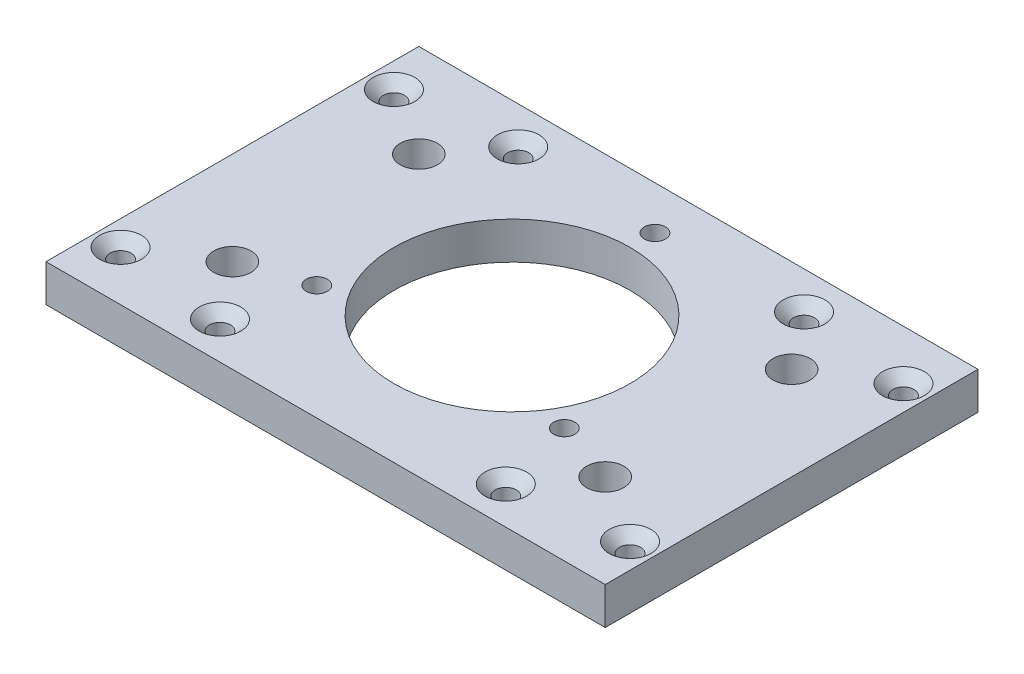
ISO-10303-21;
HEADER;
FILE_DESCRIPTION(('STEP AP214'),'2;1');
FILE_NAME('part.step','',(''),(''),'','','');
FILE_SCHEMA(('AUTOMOTIVE_DESIGN { 1 0 10303 214 1 1 1 1 }'));
ENDSEC;
DATA;
#1=APPLICATION_CONTEXT('core data for automotive mechanical design processes');
#2=APPLICATION_PROTOCOL_DEFINITION('international standard','automotive_design',2000,#1);
#3=PRODUCT_CONTEXT('',#1,'mechanical');
#4=PRODUCT('Part','Part','',(#3));
#5=PRODUCT_RELATED_PRODUCT_CATEGORY('part','',(#4));
#6=PRODUCT_DEFINITION_FORMATION('','',#4);
#7=PRODUCT_DEFINITION_CONTEXT('part definition',#1,'design');
#8=PRODUCT_DEFINITION('design','',#6,#7);
#9=PRODUCT_DEFINITION_SHAPE('','',#8);
#10=(LENGTH_UNIT() NAMED_UNIT(*) SI_UNIT(.MILLI.,.METRE.));
#11=(NAMED_UNIT(*) PLANE_ANGLE_UNIT() SI_UNIT($,.RADIAN.));
#12=(NAMED_UNIT(*) SI_UNIT($,.STERADIAN.) SOLID_ANGLE_UNIT());
#13=UNCERTAINTY_MEASURE_WITH_UNIT(LENGTH_MEASURE(1.E-05),#10,'distance_accuracy_value','');
#14=(GEOMETRIC_REPRESENTATION_CONTEXT(3) GLOBAL_UNCERTAINTY_ASSIGNED_CONTEXT((#13)) GLOBAL_UNIT_ASSIGNED_CONTEXT((#10,
#11,#12)) REPRESENTATION_CONTEXT('',''));
#15=CARTESIAN_POINT('',(0.,0.,0.));
#16=DIRECTION('',(0.,0.,1.));
#17=DIRECTION('',(1.,0.,0.));
#18=AXIS2_PLACEMENT_3D('',#15,#16,#17);
#19=CARTESIAN_POINT('',(45.,2.99999999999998,30.));
#20=DIRECTION('',(0.,-1.,0.));
#21=DIRECTION('',(0.,0.,-1.));
#22=AXIS2_PLACEMENT_3D('',#19,#20,#21);
#23=PLANE('',#22);
#24=CARTESIAN_POINT('',(-30.0000000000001,3.,-15.));
#25=DIRECTION('',(0.,1.,0.));
#26=DIRECTION('',(0.,0.,1.));
#27=AXIS2_PLACEMENT_3D('',#24,#25,#26);
#28=CIRCLE('',#27,3.);
#29=CARTESIAN_POINT('',(-30.0000000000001,3.,-12.));
#30=VERTEX_POINT('',#29);
#31=EDGE_CURVE('E252',#30,#30,#28,.T.);
#32=ORIENTED_EDGE('',*,*,#31,.F.);
#33=EDGE_LOOP('',(#32));
#34=FACE_BOUND('',#33,.T.);
#35=CARTESIAN_POINT('',(-30.0000000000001,3.00000000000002,15.));
#36=DIRECTION('',(0.,1.,0.));
#37=DIRECTION('',(0.,0.,1.));
#38=AXIS2_PLACEMENT_3D('',#35,#36,#37);
#39=CIRCLE('',#38,3.);
#40=CARTESIAN_POINT('',(-30.0000000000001,3.00000000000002,18.));
#41=VERTEX_POINT('',#40);
#42=EDGE_CURVE('E246',#41,#41,#39,.T.);
#43=ORIENTED_EDGE('',*,*,#42,.F.);
#44=EDGE_LOOP('',(#43));
#45=FACE_BOUND('',#44,.T.);
#46=DIRECTION('',(0.,0.,1.));
#47=VECTOR('',#46,1.);
#48=CARTESIAN_POINT('',(-45.0000000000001,3.,30.));
#49=LINE('',#48,#47);
#50=CARTESIAN_POINT('',(-45.0000000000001,3.00000000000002,-30.0000000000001));
#51=VERTEX_POINT('',#50);
#52=CARTESIAN_POINT('',(-45.0000000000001,3.,30.));
#53=VERTEX_POINT('',#52);
#54=EDGE_CURVE('E104',#51,#53,#49,.T.);
#55=ORIENTED_EDGE('',*,*,#54,.T.);
#56=DIRECTION('',(-1.,0.,0.));
#57=VECTOR('',#56,1.);
#58=CARTESIAN_POINT('',(45.,2.99999999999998,30.));
#59=LINE('',#58,#57);
#60=CARTESIAN_POINT('',(45.,2.99999999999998,30.));
#61=VERTEX_POINT('',#60);
#62=EDGE_CURVE('E57',#61,#53,#59,.T.);
#63=ORIENTED_EDGE('',*,*,#62,.F.);
#64=DIRECTION('',(0.,0.,1.));
#65=VECTOR('',#64,1.);
#66=CARTESIAN_POINT('',(45.,2.99999999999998,30.));
#67=LINE('',#66,#65);
#68=CARTESIAN_POINT('',(45.,3.,-30.0000000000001));
#69=VERTEX_POINT('',#68);
#70=EDGE_CURVE('E95',#69,#61,#67,.T.);
#71=ORIENTED_EDGE('',*,*,#70,.F.);
#72=DIRECTION('',(-1.,0.,0.));
#73=VECTOR('',#72,1.);
#74=CARTESIAN_POINT('',(45.,3.,-30.0000000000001));
#75=LINE('',#74,#73);
#76=EDGE_CURVE('E13',#69,#51,#75,.T.);
#77=ORIENTED_EDGE('',*,*,#76,.T.);
#78=EDGE_LOOP('',(#55,#63,#71,#77));
#79=FACE_BOUND('',#78,.T.);
#80=CARTESIAN_POINT('',(0.,3.,0.));
#81=DIRECTION('',(0.,1.,0.));
#82=DIRECTION('',(0.,0.,1.));
#83=AXIS2_PLACEMENT_3D('',#80,#81,#82);
#84=CIRCLE('',#83,19.);
#85=CARTESIAN_POINT('',(0.,3.,19.));
#86=VERTEX_POINT('',#85);
#87=EDGE_CURVE('E127',#86,#86,#84,.T.);
#88=ORIENTED_EDGE('',*,*,#87,.F.);
#89=EDGE_LOOP('',(#88));
#90=FACE_BOUND('',#89,.T.);
#91=CARTESIAN_POINT('',(-23.,3.,24.));
#92=DIRECTION('',(0.,1.,0.));
#93=DIRECTION('',(0.,0.,1.));
#94=AXIS2_PLACEMENT_3D('',#91,#92,#93);
#95=CIRCLE('',#94,3.36);
#96=CARTESIAN_POINT('',(-23.,3.,27.36));
#97=VERTEX_POINT('',#96);
#98=EDGE_CURVE('E138',#97,#97,#95,.T.);
#99=ORIENTED_EDGE('',*,*,#98,.F.);
#100=EDGE_LOOP('',(#99));
#101=FACE_BOUND('',#100,.T.);
#102=CARTESIAN_POINT('',(23.,3.,24.));
#103=DIRECTION('',(0.,1.,0.));
#104=DIRECTION('',(0.,0.,1.));
#105=AXIS2_PLACEMENT_3D('',#102,#103,#104);
#106=CIRCLE('',#105,3.36);
#107=CARTESIAN_POINT('',(23.,3.,27.36));
#108=VERTEX_POINT('',#107);
#109=EDGE_CURVE('E147',#108,#108,#106,.T.);
#110=ORIENTED_EDGE('',*,*,#109,.F.);
#111=EDGE_LOOP('',(#110));
#112=FACE_BOUND('',#111,.T.);
#113=CARTESIAN_POINT('',(23.,3.,-24.0000000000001));
#114=DIRECTION('',(0.,1.,0.));
#115=DIRECTION('',(0.,0.,1.));
#116=AXIS2_PLACEMENT_3D('',#113,#114,#115);
#117=CIRCLE('',#116,3.36);
#118=CARTESIAN_POINT('',(23.,3.,-20.6400000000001));
#119=VERTEX_POINT('',#118);
#120=EDGE_CURVE('E156',#119,#119,#117,.T.);
#121=ORIENTED_EDGE('',*,*,#120,.F.);
#122=EDGE_LOOP('',(#121));
#123=FACE_BOUND('',#122,.T.);
#124=CARTESIAN_POINT('',(-23.,3.,-24.0000000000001));
#125=DIRECTION('',(0.,1.,0.));
#126=DIRECTION('',(0.,0.,1.));
#127=AXIS2_PLACEMENT_3D('',#124,#125,#126);
#128=CIRCLE('',#127,3.36);
#129=CARTESIAN_POINT('',(-23.,3.,-20.6400000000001));
#130=VERTEX_POINT('',#129);
#131=EDGE_CURVE('E165',#130,#130,#128,.T.);
#132=ORIENTED_EDGE('',*,*,#131,.F.);
#133=EDGE_LOOP('',(#132));
#134=FACE_BOUND('',#133,.T.);
#135=CARTESIAN_POINT('',(-41.0000000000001,3.00000000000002,22.));
#136=DIRECTION('',(0.,1.,0.));
#137=DIRECTION('',(0.,0.,1.));
#138=AXIS2_PLACEMENT_3D('',#135,#136,#137);
#139=CIRCLE('',#138,3.36);
#140=CARTESIAN_POINT('',(-41.0000000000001,3.00000000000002,25.36));
#141=VERTEX_POINT('',#140);
#142=EDGE_CURVE('E174',#141,#141,#139,.T.);
#143=ORIENTED_EDGE('',*,*,#142,.F.);
#144=EDGE_LOOP('',(#143));
#145=FACE_BOUND('',#144,.T.);
#146=CARTESIAN_POINT('',(41.,3.,22.));
#147=DIRECTION('',(0.,1.,0.));
#148=DIRECTION('',(0.,0.,1.));
#149=AXIS2_PLACEMENT_3D('',#146,#147,#148);
#150=CIRCLE('',#149,3.36);
#151=CARTESIAN_POINT('',(41.,3.,25.36));
#152=VERTEX_POINT('',#151);
#153=EDGE_CURVE('E183',#152,#152,#150,.T.);
#154=ORIENTED_EDGE('',*,*,#153,.F.);
#155=EDGE_LOOP('',(#154));
#156=FACE_BOUND('',#155,.T.);
#157=CARTESIAN_POINT('',(41.,2.99999999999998,-22.));
#158=DIRECTION('',(0.,1.,0.));
#159=DIRECTION('',(0.,0.,1.));
#160=AXIS2_PLACEMENT_3D('',#157,#158,#159);
#161=CIRCLE('',#160,3.36);
#162=CARTESIAN_POINT('',(41.,2.99999999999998,-18.64));
#163=VERTEX_POINT('',#162);
#164=EDGE_CURVE('E192',#163,#163,#161,.T.);
#165=ORIENTED_EDGE('',*,*,#164,.F.);
#166=EDGE_LOOP('',(#165));
#167=FACE_BOUND('',#166,.T.);
#168=CARTESIAN_POINT('',(-41.0000000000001,3.,-22.));
#169=DIRECTION('',(0.,1.,0.));
#170=DIRECTION('',(0.,0.,1.));
#171=AXIS2_PLACEMENT_3D('',#168,#169,#170);
#172=CIRCLE('',#171,3.36);
#173=CARTESIAN_POINT('',(-41.0000000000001,3.,-18.64));
#174=VERTEX_POINT('',#173);
#175=EDGE_CURVE('E201',#174,#174,#172,.T.);
#176=ORIENTED_EDGE('',*,*,#175,.F.);
#177=EDGE_LOOP('',(#176));
#178=FACE_BOUND('',#177,.T.);
#179=CARTESIAN_POINT('',(0.,3.,-23.));
#180=DIRECTION('',(0.,-1.,0.));
#181=DIRECTION('',(0.,0.,-1.));
#182=AXIS2_PLACEMENT_3D('',#179,#180,#181);
#183=CIRCLE('',#182,1.7);
#184=CARTESIAN_POINT('',(0.,3.,-24.7));
#185=VERTEX_POINT('',#184);
#186=EDGE_CURVE('E204',#185,#185,#183,.T.);
#187=ORIENTED_EDGE('',*,*,#186,.T.);
#188=EDGE_LOOP('',(#187));
#189=FACE_BOUND('',#188,.T.);
#190=CARTESIAN_POINT('',(19.9185842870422,3.,11.5));
#191=DIRECTION('',(0.,-1.,0.));
#192=DIRECTION('',(0.,0.,-1.));
#193=AXIS2_PLACEMENT_3D('',#190,#191,#192);
#194=CIRCLE('',#193,1.7);
#195=CARTESIAN_POINT('',(19.9185842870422,3.,9.79999999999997));
#196=VERTEX_POINT('',#195);
#197=EDGE_CURVE('E213',#196,#196,#194,.T.);
#198=ORIENTED_EDGE('',*,*,#197,.T.);
#199=EDGE_LOOP('',(#198));
#200=FACE_BOUND('',#199,.T.);
#201=CARTESIAN_POINT('',(-19.9185842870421,3.00000000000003,11.5));
#202=DIRECTION('',(0.,-1.,0.));
#203=DIRECTION('',(0.,0.,-1.));
#204=AXIS2_PLACEMENT_3D('',#201,#202,#203);
#205=CIRCLE('',#204,1.7);
#206=CARTESIAN_POINT('',(-19.9185842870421,3.00000000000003,9.79999999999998));
#207=VERTEX_POINT('',#206);
#208=EDGE_CURVE('E222',#207,#207,#205,.T.);
#209=ORIENTED_EDGE('',*,*,#208,.T.);
#210=EDGE_LOOP('',(#209));
#211=FACE_BOUND('',#210,.T.);
#212=CARTESIAN_POINT('',(30.0000000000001,2.99999999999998,-15.));
#213=DIRECTION('',(0.,1.,0.));
#214=DIRECTION('',(0.,0.,1.));
#215=AXIS2_PLACEMENT_3D('',#212,#213,#214);
#216=CIRCLE('',#215,3.);
#217=CARTESIAN_POINT('',(30.0000000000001,2.99999999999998,-12.));
#218=VERTEX_POINT('',#217);
#219=EDGE_CURVE('E234',#218,#218,#216,.T.);
#220=ORIENTED_EDGE('',*,*,#219,.F.);
#221=EDGE_LOOP('',(#220));
#222=FACE_BOUND('',#221,.T.);
#223=CARTESIAN_POINT('',(30.0000000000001,3.,15.));
#224=DIRECTION('',(0.,1.,0.));
#225=DIRECTION('',(0.,0.,1.));
#226=AXIS2_PLACEMENT_3D('',#223,#224,#225);
#227=CIRCLE('',#226,3.);
#228=CARTESIAN_POINT('',(30.0000000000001,3.,18.));
#229=VERTEX_POINT('',#228);
#230=EDGE_CURVE('E240',#229,#229,#227,.T.);
#231=ORIENTED_EDGE('',*,*,#230,.F.);
#232=EDGE_LOOP('',(#231));
#233=FACE_BOUND('',#232,.T.);
#234=ADVANCED_FACE('F48',(#34,#45,#79,#90,#101,#112,#123,#134,#145,#156,#167,#178,#189,#200,
#211,#222,#233),#23,.F.);
#235=CARTESIAN_POINT('',(45.0000000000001,-3.00000000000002,30.0000000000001));
#236=DIRECTION('',(0.,1.,0.));
#237=DIRECTION('',(0.,0.,1.));
#238=AXIS2_PLACEMENT_3D('',#235,#236,#237);
#239=PLANE('',#238);
#240=CARTESIAN_POINT('',(-30.0000000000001,-3.,-15.));
#241=DIRECTION('',(0.,1.,0.));
#242=DIRECTION('',(0.,0.,1.));
#243=AXIS2_PLACEMENT_3D('',#240,#241,#242);
#244=CIRCLE('',#243,3.);
#245=CARTESIAN_POINT('',(-30.0000000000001,-3.,-12.));
#246=VERTEX_POINT('',#245);
#247=EDGE_CURVE('E249',#246,#246,#244,.T.);
#248=ORIENTED_EDGE('',*,*,#247,.T.);
#249=EDGE_LOOP('',(#248));
#250=FACE_BOUND('',#249,.T.);
#251=CARTESIAN_POINT('',(-30.0000000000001,-2.99999999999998,15.));
#252=DIRECTION('',(0.,1.,0.));
#253=DIRECTION('',(0.,0.,1.));
#254=AXIS2_PLACEMENT_3D('',#251,#252,#253);
#255=CIRCLE('',#254,3.);
#256=CARTESIAN_POINT('',(-30.0000000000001,-2.99999999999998,18.));
#257=VERTEX_POINT('',#256);
#258=EDGE_CURVE('E243',#257,#257,#255,.T.);
#259=ORIENTED_EDGE('',*,*,#258,.T.);
#260=EDGE_LOOP('',(#259));
#261=FACE_BOUND('',#260,.T.);
#262=CARTESIAN_POINT('',(30.0000000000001,-3.,15.));
#263=DIRECTION('',(0.,1.,0.));
#264=DIRECTION('',(0.,0.,1.));
#265=AXIS2_PLACEMENT_3D('',#262,#263,#264);
#266=CIRCLE('',#265,3.);
#267=CARTESIAN_POINT('',(30.0000000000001,-3.,18.));
#268=VERTEX_POINT('',#267);
#269=EDGE_CURVE('E237',#268,#268,#266,.T.);
#270=ORIENTED_EDGE('',*,*,#269,.T.);
#271=EDGE_LOOP('',(#270));
#272=FACE_BOUND('',#271,.T.);
#273=CARTESIAN_POINT('',(30.0000000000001,-3.00000000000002,-15.));
#274=DIRECTION('',(0.,1.,0.));
#275=DIRECTION('',(0.,0.,1.));
#276=AXIS2_PLACEMENT_3D('',#273,#274,#275);
#277=CIRCLE('',#276,3.);
#278=CARTESIAN_POINT('',(30.0000000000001,-3.00000000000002,-12.));
#279=VERTEX_POINT('',#278);
#280=EDGE_CURVE('E231',#279,#279,#277,.T.);
#281=ORIENTED_EDGE('',*,*,#280,.T.);
#282=EDGE_LOOP('',(#281));
#283=FACE_BOUND('',#282,.T.);
#284=CARTESIAN_POINT('',(-19.9185842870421,-2.99999999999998,11.5));
#285=DIRECTION('',(0.,-1.,0.));
#286=DIRECTION('',(0.,0.,-1.));
#287=AXIS2_PLACEMENT_3D('',#284,#285,#286);
#288=CIRCLE('',#287,3.36);
#289=CARTESIAN_POINT('',(-19.9185842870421,-2.99999999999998,8.13999999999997));
#290=VERTEX_POINT('',#289);
#291=EDGE_CURVE('E228',#290,#290,#288,.T.);
#292=ORIENTED_EDGE('',*,*,#291,.F.);
#293=EDGE_LOOP('',(#292));
#294=FACE_BOUND('',#293,.T.);
#295=DIRECTION('',(0.,0.,-1.));
#296=VECTOR('',#295,1.);
#297=CARTESIAN_POINT('',(-45.0000000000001,-3.,30.0000000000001));
#298=LINE('',#297,#296);
#299=CARTESIAN_POINT('',(-45.0000000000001,-3.,30.0000000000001));
#300=VERTEX_POINT('',#299);
#301=CARTESIAN_POINT('',(-45.0000000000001,-2.99999999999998,-30.0000000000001));
#302=VERTEX_POINT('',#301);
#303=EDGE_CURVE('E88',#300,#302,#298,.T.);
#304=ORIENTED_EDGE('',*,*,#303,.T.);
#305=DIRECTION('',(-1.,0.,0.));
#306=VECTOR('',#305,1.);
#307=CARTESIAN_POINT('',(45.0000000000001,-3.,-30.0000000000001));
#308=LINE('',#307,#306);
#309=CARTESIAN_POINT('',(45.0000000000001,-3.,-30.0000000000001));
#310=VERTEX_POINT('',#309);
#311=EDGE_CURVE('E108',#310,#302,#308,.T.);
#312=ORIENTED_EDGE('',*,*,#311,.F.);
#313=DIRECTION('',(0.,0.,-1.));
#314=VECTOR('',#313,1.);
#315=CARTESIAN_POINT('',(45.0000000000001,-3.00000000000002,30.0000000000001));
#316=LINE('',#315,#314);
#317=CARTESIAN_POINT('',(45.0000000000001,-3.00000000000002,30.0000000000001));
#318=VERTEX_POINT('',#317);
#319=EDGE_CURVE('E65',#318,#310,#316,.T.);
#320=ORIENTED_EDGE('',*,*,#319,.F.);
#321=DIRECTION('',(-1.,0.,0.));
#322=VECTOR('',#321,1.);
#323=CARTESIAN_POINT('',(45.0000000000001,-3.00000000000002,30.0000000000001));
#324=LINE('',#323,#322);
#325=EDGE_CURVE('E105',#318,#300,#324,.T.);
#326=ORIENTED_EDGE('',*,*,#325,.T.);
#327=EDGE_LOOP('',(#304,#312,#320,#326));
#328=FACE_BOUND('',#327,.T.);
#329=CARTESIAN_POINT('',(0.,-3.,0.));
#330=DIRECTION('',(0.,1.,0.));
#331=DIRECTION('',(0.,0.,1.));
#332=AXIS2_PLACEMENT_3D('',#329,#330,#331);
#333=CIRCLE('',#332,19.);
#334=CARTESIAN_POINT('',(0.,-3.,19.));
#335=VERTEX_POINT('',#334);
#336=EDGE_CURVE('E115',#335,#335,#333,.T.);
#337=ORIENTED_EDGE('',*,*,#336,.T.);
#338=EDGE_LOOP('',(#337));
#339=FACE_BOUND('',#338,.T.);
#340=CARTESIAN_POINT('',(-23.,-3.,24.0000000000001));
#341=DIRECTION('',(0.,1.,0.));
#342=DIRECTION('',(0.,0.,1.));
#343=AXIS2_PLACEMENT_3D('',#340,#341,#342);
#344=CIRCLE('',#343,1.7);
#345=CARTESIAN_POINT('',(-23.,-3.,25.7000000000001));
#346=VERTEX_POINT('',#345);
#347=EDGE_CURVE('E130',#346,#346,#344,.T.);
#348=ORIENTED_EDGE('',*,*,#347,.T.);
#349=EDGE_LOOP('',(#348));
#350=FACE_BOUND('',#349,.T.);
#351=CARTESIAN_POINT('',(23.,-3.,24.0000000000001));
#352=DIRECTION('',(0.,1.,0.));
#353=DIRECTION('',(0.,0.,1.));
#354=AXIS2_PLACEMENT_3D('',#351,#352,#353);
#355=CIRCLE('',#354,1.7);
#356=CARTESIAN_POINT('',(23.,-3.,25.7000000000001));
#357=VERTEX_POINT('',#356);
#358=EDGE_CURVE('E141',#357,#357,#355,.T.);
#359=ORIENTED_EDGE('',*,*,#358,.T.);
#360=EDGE_LOOP('',(#359));
#361=FACE_BOUND('',#360,.T.);
#362=CARTESIAN_POINT('',(23.,-3.,-24.0000000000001));
#363=DIRECTION('',(0.,1.,0.));
#364=DIRECTION('',(0.,0.,1.));
#365=AXIS2_PLACEMENT_3D('',#362,#363,#364);
#366=CIRCLE('',#365,1.7);
#367=CARTESIAN_POINT('',(23.,-3.,-22.3000000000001));
#368=VERTEX_POINT('',#367);
#369=EDGE_CURVE('E150',#368,#368,#366,.T.);
#370=ORIENTED_EDGE('',*,*,#369,.T.);
#371=EDGE_LOOP('',(#370));
#372=FACE_BOUND('',#371,.T.);
#373=CARTESIAN_POINT('',(-23.,-3.,-24.0000000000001));
#374=DIRECTION('',(0.,1.,0.));
#375=DIRECTION('',(0.,0.,1.));
#376=AXIS2_PLACEMENT_3D('',#373,#374,#375);
#377=CIRCLE('',#376,1.7);
#378=CARTESIAN_POINT('',(-23.,-3.,-22.3000000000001));
#379=VERTEX_POINT('',#378);
#380=EDGE_CURVE('E159',#379,#379,#377,.T.);
#381=ORIENTED_EDGE('',*,*,#380,.T.);
#382=EDGE_LOOP('',(#381));
#383=FACE_BOUND('',#382,.T.);
#384=CARTESIAN_POINT('',(-41.,-2.99999999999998,22.));
#385=DIRECTION('',(0.,1.,0.));
#386=DIRECTION('',(0.,0.,1.));
#387=AXIS2_PLACEMENT_3D('',#384,#385,#386);
#388=CIRCLE('',#387,1.7);
#389=CARTESIAN_POINT('',(-41.,-2.99999999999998,23.7));
#390=VERTEX_POINT('',#389);
#391=EDGE_CURVE('E168',#390,#390,#388,.T.);
#392=ORIENTED_EDGE('',*,*,#391,.T.);
#393=EDGE_LOOP('',(#392));
#394=FACE_BOUND('',#393,.T.);
#395=CARTESIAN_POINT('',(41.0000000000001,-3.,22.));
#396=DIRECTION('',(0.,1.,0.));
#397=DIRECTION('',(0.,0.,1.));
#398=AXIS2_PLACEMENT_3D('',#395,#396,#397);
#399=CIRCLE('',#398,1.7);
#400=CARTESIAN_POINT('',(41.0000000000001,-3.,23.7));
#401=VERTEX_POINT('',#400);
#402=EDGE_CURVE('E177',#401,#401,#399,.T.);
#403=ORIENTED_EDGE('',*,*,#402,.T.);
#404=EDGE_LOOP('',(#403));
#405=FACE_BOUND('',#404,.T.);
#406=CARTESIAN_POINT('',(41.0000000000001,-3.00000000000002,-22.));
#407=DIRECTION('',(0.,1.,0.));
#408=DIRECTION('',(0.,0.,1.));
#409=AXIS2_PLACEMENT_3D('',#406,#407,#408);
#410=CIRCLE('',#409,1.7);
#411=CARTESIAN_POINT('',(41.0000000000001,-3.00000000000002,-20.3));
#412=VERTEX_POINT('',#411);
#413=EDGE_CURVE('E186',#412,#412,#410,.T.);
#414=ORIENTED_EDGE('',*,*,#413,.T.);
#415=EDGE_LOOP('',(#414));
#416=FACE_BOUND('',#415,.T.);
#417=CARTESIAN_POINT('',(-41.,-3.,-22.));
#418=DIRECTION('',(0.,1.,0.));
#419=DIRECTION('',(0.,0.,1.));
#420=AXIS2_PLACEMENT_3D('',#417,#418,#419);
#421=CIRCLE('',#420,1.7);
#422=CARTESIAN_POINT('',(-41.,-3.,-20.3));
#423=VERTEX_POINT('',#422);
#424=EDGE_CURVE('E195',#423,#423,#421,.T.);
#425=ORIENTED_EDGE('',*,*,#424,.T.);
#426=EDGE_LOOP('',(#425));
#427=FACE_BOUND('',#426,.T.);
#428=CARTESIAN_POINT('',(0.,-3.,-23.));
#429=DIRECTION('',(0.,-1.,0.));
#430=DIRECTION('',(0.,0.,-1.));
#431=AXIS2_PLACEMENT_3D('',#428,#429,#430);
#432=CIRCLE('',#431,3.36);
#433=CARTESIAN_POINT('',(0.,-3.,-26.36));
#434=VERTEX_POINT('',#433);
#435=EDGE_CURVE('E210',#434,#434,#432,.T.);
#436=ORIENTED_EDGE('',*,*,#435,.F.);
#437=EDGE_LOOP('',(#436));
#438=FACE_BOUND('',#437,.T.);
#439=CARTESIAN_POINT('',(19.9185842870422,-3.,11.5));
#440=DIRECTION('',(0.,-1.,0.));
#441=DIRECTION('',(0.,0.,-1.));
#442=AXIS2_PLACEMENT_3D('',#439,#440,#441);
#443=CIRCLE('',#442,3.36);
#444=CARTESIAN_POINT('',(19.9185842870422,-3.,8.13999999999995));
#445=VERTEX_POINT('',#444);
#446=EDGE_CURVE('E219',#445,#445,#443,.T.);
#447=ORIENTED_EDGE('',*,*,#446,.F.);
#448=EDGE_LOOP('',(#447));
#449=FACE_BOUND('',#448,.T.);
#450=ADVANCED_FACE('F120',(#250,#261,#272,#283,#294,#328,#339,#350,#361,#372,#383,#394,#405,
#416,#427,#438,#449),#239,.F.);
#451=CARTESIAN_POINT('',(45.0000000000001,-3.,-30.0000000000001));
#452=DIRECTION('',(0.,0.,1.));
#453=DIRECTION('',(1.,0.,0.));
#454=AXIS2_PLACEMENT_3D('',#451,#452,#453);
#455=PLANE('',#454);
#456=DIRECTION('',(0.,1.,0.));
#457=VECTOR('',#456,1.);
#458=CARTESIAN_POINT('',(-45.0000000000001,-2.99999999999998,-30.0000000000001));
#459=LINE('',#458,#457);
#460=EDGE_CURVE('E112',#302,#51,#459,.T.);
#461=ORIENTED_EDGE('',*,*,#460,.T.);
#462=ORIENTED_EDGE('',*,*,#76,.F.);
#463=DIRECTION('',(0.,1.,0.));
#464=VECTOR('',#463,1.);
#465=CARTESIAN_POINT('',(45.0000000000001,-3.,-30.0000000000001));
#466=LINE('',#465,#464);
#467=EDGE_CURVE('E100',#310,#69,#466,.T.);
#468=ORIENTED_EDGE('',*,*,#467,.F.);
#469=ORIENTED_EDGE('',*,*,#311,.T.);
#470=EDGE_LOOP('',(#461,#462,#468,#469));
#471=FACE_BOUND('',#470,.T.);
#472=ADVANCED_FACE('F50',(#471),#455,.F.);
#473=CARTESIAN_POINT('',(45.0000000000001,-3.00000000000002,30.0000000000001));
#474=DIRECTION('',(0.,0.,-1.));
#475=DIRECTION('',(-1.,0.,0.));
#476=AXIS2_PLACEMENT_3D('',#473,#474,#475);
#477=PLANE('',#476);
#478=DIRECTION('',(0.,-1.,0.));
#479=VECTOR('',#478,1.);
#480=CARTESIAN_POINT('',(-45.0000000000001,-3.,30.0000000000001));
#481=LINE('',#480,#479);
#482=EDGE_CURVE('E82',#53,#300,#481,.T.);
#483=ORIENTED_EDGE('',*,*,#482,.T.);
#484=ORIENTED_EDGE('',*,*,#325,.F.);
#485=DIRECTION('',(0.,-1.,0.));
#486=VECTOR('',#485,1.);
#487=CARTESIAN_POINT('',(45.0000000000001,-3.00000000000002,30.0000000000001));
#488=LINE('',#487,#486);
#489=EDGE_CURVE('E98',#61,#318,#488,.T.);
#490=ORIENTED_EDGE('',*,*,#489,.F.);
#491=ORIENTED_EDGE('',*,*,#62,.T.);
#492=EDGE_LOOP('',(#483,#484,#490,#491));
#493=FACE_BOUND('',#492,.T.);
#494=ADVANCED_FACE('F106',(#493),#477,.F.);
#495=CARTESIAN_POINT('',(45.0000000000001,0.,0.));
#496=DIRECTION('',(-1.,0.,0.));
#497=DIRECTION('',(0.,0.,1.));
#498=AXIS2_PLACEMENT_3D('',#495,#496,#497);
#499=PLANE('',#498);
#500=ORIENTED_EDGE('',*,*,#467,.T.);
#501=ORIENTED_EDGE('',*,*,#70,.T.);
#502=ORIENTED_EDGE('',*,*,#489,.T.);
#503=ORIENTED_EDGE('',*,*,#319,.T.);
#504=EDGE_LOOP('',(#500,#501,#502,#503));
#505=FACE_BOUND('',#504,.T.);
#506=ADVANCED_FACE('F96',(#505),#499,.F.);
#507=CARTESIAN_POINT('',(-45.0000000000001,0.,0.));
#508=DIRECTION('',(-1.,0.,0.));
#509=DIRECTION('',(0.,0.,1.));
#510=AXIS2_PLACEMENT_3D('',#507,#508,#509);
#511=PLANE('',#510);
#512=ORIENTED_EDGE('',*,*,#460,.F.);
#513=ORIENTED_EDGE('',*,*,#303,.F.);
#514=ORIENTED_EDGE('',*,*,#482,.F.);
#515=ORIENTED_EDGE('',*,*,#54,.F.);
#516=EDGE_LOOP('',(#512,#513,#514,#515));
#517=FACE_BOUND('',#516,.T.);
#518=ADVANCED_FACE('F124',(#517),#511,.T.);
#519=CARTESIAN_POINT('',(0.,-3.,0.));
#520=DIRECTION('',(0.,1.,0.));
#521=DIRECTION('',(0.,0.,1.));
#522=AXIS2_PLACEMENT_3D('',#519,#520,#521);
#523=CYLINDRICAL_SURFACE('',#522,19.);
#524=ORIENTED_EDGE('',*,*,#336,.F.);
#525=EDGE_LOOP('',(#524));
#526=FACE_BOUND('',#525,.T.);
#527=ORIENTED_EDGE('',*,*,#87,.T.);
#528=EDGE_LOOP('',(#527));
#529=FACE_BOUND('',#528,.T.);
#530=ADVANCED_FACE('F368',(#526,#529),#523,.F.);
#531=CARTESIAN_POINT('',(-23.,3.,24.));
#532=DIRECTION('',(0.,1.,0.));
#533=DIRECTION('',(0.,0.,1.));
#534=AXIS2_PLACEMENT_3D('',#531,#532,#533);
#535=CYLINDRICAL_SURFACE('',#534,1.7);
#536=ORIENTED_EDGE('',*,*,#347,.F.);
#537=EDGE_LOOP('',(#536));
#538=FACE_BOUND('',#537,.T.);
#539=CARTESIAN_POINT('',(-23.,1.34,24.0000000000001));
#540=DIRECTION('',(0.,1.,0.));
#541=DIRECTION('',(0.,0.,1.));
#542=AXIS2_PLACEMENT_3D('',#539,#540,#541);
#543=CIRCLE('',#542,1.7);
#544=CARTESIAN_POINT('',(-23.,1.34,25.7000000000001));
#545=VERTEX_POINT('',#544);
#546=EDGE_CURVE('E135',#545,#545,#543,.T.);
#547=ORIENTED_EDGE('',*,*,#546,.T.);
#548=EDGE_LOOP('',(#547));
#549=FACE_BOUND('',#548,.T.);
#550=ADVANCED_FACE('F364',(#538,#549),#535,.F.);
#551=CARTESIAN_POINT('',(-23.,3.,24.));
#552=DIRECTION('',(0.,1.,0.));
#553=DIRECTION('',(0.,0.,1.));
#554=AXIS2_PLACEMENT_3D('',#551,#552,#553);
#555=CONICAL_SURFACE('',#554,3.36,0.785398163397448);
#556=ORIENTED_EDGE('',*,*,#546,.F.);
#557=EDGE_LOOP('',(#556));
#558=FACE_BOUND('',#557,.T.);
#559=ORIENTED_EDGE('',*,*,#98,.T.);
#560=EDGE_LOOP('',(#559));
#561=FACE_BOUND('',#560,.T.);
#562=ADVANCED_FACE('F360',(#558,#561),#555,.F.);
#563=CARTESIAN_POINT('',(23.,3.,24.));
#564=DIRECTION('',(0.,1.,0.));
#565=DIRECTION('',(0.,0.,1.));
#566=AXIS2_PLACEMENT_3D('',#563,#564,#565);
#567=CYLINDRICAL_SURFACE('',#566,1.7);
#568=ORIENTED_EDGE('',*,*,#358,.F.);
#569=EDGE_LOOP('',(#568));
#570=FACE_BOUND('',#569,.T.);
#571=CARTESIAN_POINT('',(23.,1.34,24.0000000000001));
#572=DIRECTION('',(0.,1.,0.));
#573=DIRECTION('',(0.,0.,1.));
#574=AXIS2_PLACEMENT_3D('',#571,#572,#573);
#575=CIRCLE('',#574,1.7);
#576=CARTESIAN_POINT('',(23.,1.34,25.7000000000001));
#577=VERTEX_POINT('',#576);
#578=EDGE_CURVE('E144',#577,#577,#575,.T.);
#579=ORIENTED_EDGE('',*,*,#578,.T.);
#580=EDGE_LOOP('',(#579));
#581=FACE_BOUND('',#580,.T.);
#582=ADVANCED_FACE('F356',(#570,#581),#567,.F.);
#583=CARTESIAN_POINT('',(23.,3.,24.));
#584=DIRECTION('',(0.,1.,0.));
#585=DIRECTION('',(0.,0.,1.));
#586=AXIS2_PLACEMENT_3D('',#583,#584,#585);
#587=CONICAL_SURFACE('',#586,3.36,0.785398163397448);
#588=ORIENTED_EDGE('',*,*,#578,.F.);
#589=EDGE_LOOP('',(#588));
#590=FACE_BOUND('',#589,.T.);
#591=ORIENTED_EDGE('',*,*,#109,.T.);
#592=EDGE_LOOP('',(#591));
#593=FACE_BOUND('',#592,.T.);
#594=ADVANCED_FACE('F352',(#590,#593),#587,.F.);
#595=CARTESIAN_POINT('',(23.,3.,-24.0000000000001));
#596=DIRECTION('',(0.,1.,0.));
#597=DIRECTION('',(0.,0.,1.));
#598=AXIS2_PLACEMENT_3D('',#595,#596,#597);
#599=CYLINDRICAL_SURFACE('',#598,1.7);
#600=ORIENTED_EDGE('',*,*,#369,.F.);
#601=EDGE_LOOP('',(#600));
#602=FACE_BOUND('',#601,.T.);
#603=CARTESIAN_POINT('',(23.,1.34,-24.0000000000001));
#604=DIRECTION('',(0.,1.,0.));
#605=DIRECTION('',(0.,0.,1.));
#606=AXIS2_PLACEMENT_3D('',#603,#604,#605);
#607=CIRCLE('',#606,1.7);
#608=CARTESIAN_POINT('',(23.,1.34,-22.3000000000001));
#609=VERTEX_POINT('',#608);
#610=EDGE_CURVE('E153',#609,#609,#607,.T.);
#611=ORIENTED_EDGE('',*,*,#610,.T.);
#612=EDGE_LOOP('',(#611));
#613=FACE_BOUND('',#612,.T.);
#614=ADVANCED_FACE('F348',(#602,#613),#599,.F.);
#615=CARTESIAN_POINT('',(23.,3.,-24.0000000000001));
#616=DIRECTION('',(0.,1.,0.));
#617=DIRECTION('',(0.,0.,1.));
#618=AXIS2_PLACEMENT_3D('',#615,#616,#617);
#619=CONICAL_SURFACE('',#618,3.36,0.785398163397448);
#620=ORIENTED_EDGE('',*,*,#610,.F.);
#621=EDGE_LOOP('',(#620));
#622=FACE_BOUND('',#621,.T.);
#623=ORIENTED_EDGE('',*,*,#120,.T.);
#624=EDGE_LOOP('',(#623));
#625=FACE_BOUND('',#624,.T.);
#626=ADVANCED_FACE('F344',(#622,#625),#619,.F.);
#627=CARTESIAN_POINT('',(-23.,3.,-24.0000000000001));
#628=DIRECTION('',(0.,1.,0.));
#629=DIRECTION('',(0.,0.,1.));
#630=AXIS2_PLACEMENT_3D('',#627,#628,#629);
#631=CYLINDRICAL_SURFACE('',#630,1.7);
#632=ORIENTED_EDGE('',*,*,#380,.F.);
#633=EDGE_LOOP('',(#632));
#634=FACE_BOUND('',#633,.T.);
#635=CARTESIAN_POINT('',(-23.,1.34,-24.0000000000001));
#636=DIRECTION('',(0.,1.,0.));
#637=DIRECTION('',(0.,0.,1.));
#638=AXIS2_PLACEMENT_3D('',#635,#636,#637);
#639=CIRCLE('',#638,1.7);
#640=CARTESIAN_POINT('',(-23.,1.34,-22.3000000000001));
#641=VERTEX_POINT('',#640);
#642=EDGE_CURVE('E162',#641,#641,#639,.T.);
#643=ORIENTED_EDGE('',*,*,#642,.T.);
#644=EDGE_LOOP('',(#643));
#645=FACE_BOUND('',#644,.T.);
#646=ADVANCED_FACE('F340',(#634,#645),#631,.F.);
#647=CARTESIAN_POINT('',(-23.,3.,-24.0000000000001));
#648=DIRECTION('',(0.,1.,0.));
#649=DIRECTION('',(0.,0.,1.));
#650=AXIS2_PLACEMENT_3D('',#647,#648,#649);
#651=CONICAL_SURFACE('',#650,3.36,0.785398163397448);
#652=ORIENTED_EDGE('',*,*,#642,.F.);
#653=EDGE_LOOP('',(#652));
#654=FACE_BOUND('',#653,.T.);
#655=ORIENTED_EDGE('',*,*,#131,.T.);
#656=EDGE_LOOP('',(#655));
#657=FACE_BOUND('',#656,.T.);
#658=ADVANCED_FACE('F336',(#654,#657),#651,.F.);
#659=CARTESIAN_POINT('',(-41.0000000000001,3.00000000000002,22.));
#660=DIRECTION('',(0.,1.,0.));
#661=DIRECTION('',(0.,0.,1.));
#662=AXIS2_PLACEMENT_3D('',#659,#660,#661);
#663=CYLINDRICAL_SURFACE('',#662,1.7);
#664=ORIENTED_EDGE('',*,*,#391,.F.);
#665=EDGE_LOOP('',(#664));
#666=FACE_BOUND('',#665,.T.);
#667=CARTESIAN_POINT('',(-41.0000000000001,1.34000000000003,22.));
#668=DIRECTION('',(0.,1.,0.));
#669=DIRECTION('',(0.,0.,1.));
#670=AXIS2_PLACEMENT_3D('',#667,#668,#669);
#671=CIRCLE('',#670,1.7);
#672=CARTESIAN_POINT('',(-41.0000000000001,1.34000000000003,23.7));
#673=VERTEX_POINT('',#672);
#674=EDGE_CURVE('E171',#673,#673,#671,.T.);
#675=ORIENTED_EDGE('',*,*,#674,.T.);
#676=EDGE_LOOP('',(#675));
#677=FACE_BOUND('',#676,.T.);
#678=ADVANCED_FACE('F332',(#666,#677),#663,.F.);
#679=CARTESIAN_POINT('',(-41.0000000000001,3.00000000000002,22.));
#680=DIRECTION('',(0.,1.,0.));
#681=DIRECTION('',(0.,0.,1.));
#682=AXIS2_PLACEMENT_3D('',#679,#680,#681);
#683=CONICAL_SURFACE('',#682,3.36,0.785398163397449);
#684=ORIENTED_EDGE('',*,*,#674,.F.);
#685=EDGE_LOOP('',(#684));
#686=FACE_BOUND('',#685,.T.);
#687=ORIENTED_EDGE('',*,*,#142,.T.);
#688=EDGE_LOOP('',(#687));
#689=FACE_BOUND('',#688,.T.);
#690=ADVANCED_FACE('F328',(#686,#689),#683,.F.);
#691=CARTESIAN_POINT('',(41.,3.,22.));
#692=DIRECTION('',(0.,1.,0.));
#693=DIRECTION('',(0.,0.,1.));
#694=AXIS2_PLACEMENT_3D('',#691,#692,#693);
#695=CYLINDRICAL_SURFACE('',#694,1.7);
#696=ORIENTED_EDGE('',*,*,#402,.F.);
#697=EDGE_LOOP('',(#696));
#698=FACE_BOUND('',#697,.T.);
#699=CARTESIAN_POINT('',(41.,1.34,22.));
#700=DIRECTION('',(0.,1.,0.));
#701=DIRECTION('',(0.,0.,1.));
#702=AXIS2_PLACEMENT_3D('',#699,#700,#701);
#703=CIRCLE('',#702,1.7);
#704=CARTESIAN_POINT('',(41.,1.34,23.7));
#705=VERTEX_POINT('',#704);
#706=EDGE_CURVE('E180',#705,#705,#703,.T.);
#707=ORIENTED_EDGE('',*,*,#706,.T.);
#708=EDGE_LOOP('',(#707));
#709=FACE_BOUND('',#708,.T.);
#710=ADVANCED_FACE('F324',(#698,#709),#695,.F.);
#711=CARTESIAN_POINT('',(41.,3.,22.));
#712=DIRECTION('',(0.,1.,0.));
#713=DIRECTION('',(0.,0.,1.));
#714=AXIS2_PLACEMENT_3D('',#711,#712,#713);
#715=CONICAL_SURFACE('',#714,3.36,0.785398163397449);
#716=ORIENTED_EDGE('',*,*,#706,.F.);
#717=EDGE_LOOP('',(#716));
#718=FACE_BOUND('',#717,.T.);
#719=ORIENTED_EDGE('',*,*,#153,.T.);
#720=EDGE_LOOP('',(#719));
#721=FACE_BOUND('',#720,.T.);
#722=ADVANCED_FACE('F320',(#718,#721),#715,.F.);
#723=CARTESIAN_POINT('',(41.,2.99999999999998,-22.));
#724=DIRECTION('',(0.,1.,0.));
#725=DIRECTION('',(0.,0.,1.));
#726=AXIS2_PLACEMENT_3D('',#723,#724,#725);
#727=CYLINDRICAL_SURFACE('',#726,1.7);
#728=ORIENTED_EDGE('',*,*,#413,.F.);
#729=EDGE_LOOP('',(#728));
#730=FACE_BOUND('',#729,.T.);
#731=CARTESIAN_POINT('',(41.,1.33999999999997,-22.));
#732=DIRECTION('',(0.,1.,0.));
#733=DIRECTION('',(0.,0.,1.));
#734=AXIS2_PLACEMENT_3D('',#731,#732,#733);
#735=CIRCLE('',#734,1.7);
#736=CARTESIAN_POINT('',(41.,1.33999999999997,-20.3));
#737=VERTEX_POINT('',#736);
#738=EDGE_CURVE('E189',#737,#737,#735,.T.);
#739=ORIENTED_EDGE('',*,*,#738,.T.);
#740=EDGE_LOOP('',(#739));
#741=FACE_BOUND('',#740,.T.);
#742=ADVANCED_FACE('F316',(#730,#741),#727,.F.);
#743=CARTESIAN_POINT('',(41.,2.99999999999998,-22.));
#744=DIRECTION('',(0.,1.,0.));
#745=DIRECTION('',(0.,0.,1.));
#746=AXIS2_PLACEMENT_3D('',#743,#744,#745);
#747=CONICAL_SURFACE('',#746,3.36,0.785398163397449);
#748=ORIENTED_EDGE('',*,*,#738,.F.);
#749=EDGE_LOOP('',(#748));
#750=FACE_BOUND('',#749,.T.);
#751=ORIENTED_EDGE('',*,*,#164,.T.);
#752=EDGE_LOOP('',(#751));
#753=FACE_BOUND('',#752,.T.);
#754=ADVANCED_FACE('F312',(#750,#753),#747,.F.);
#755=CARTESIAN_POINT('',(-41.0000000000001,3.,-22.));
#756=DIRECTION('',(0.,1.,0.));
#757=DIRECTION('',(0.,0.,1.));
#758=AXIS2_PLACEMENT_3D('',#755,#756,#757);
#759=CYLINDRICAL_SURFACE('',#758,1.7);
#760=ORIENTED_EDGE('',*,*,#424,.F.);
#761=EDGE_LOOP('',(#760));
#762=FACE_BOUND('',#761,.T.);
#763=CARTESIAN_POINT('',(-41.0000000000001,1.34,-22.));
#764=DIRECTION('',(0.,1.,0.));
#765=DIRECTION('',(0.,0.,1.));
#766=AXIS2_PLACEMENT_3D('',#763,#764,#765);
#767=CIRCLE('',#766,1.7);
#768=CARTESIAN_POINT('',(-41.0000000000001,1.34,-20.3));
#769=VERTEX_POINT('',#768);
#770=EDGE_CURVE('E198',#769,#769,#767,.T.);
#771=ORIENTED_EDGE('',*,*,#770,.T.);
#772=EDGE_LOOP('',(#771));
#773=FACE_BOUND('',#772,.T.);
#774=ADVANCED_FACE('F308',(#762,#773),#759,.F.);
#775=CARTESIAN_POINT('',(-41.0000000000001,3.,-22.));
#776=DIRECTION('',(0.,1.,0.));
#777=DIRECTION('',(0.,0.,1.));
#778=AXIS2_PLACEMENT_3D('',#775,#776,#777);
#779=CONICAL_SURFACE('',#778,3.36,0.785398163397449);
#780=ORIENTED_EDGE('',*,*,#770,.F.);
#781=EDGE_LOOP('',(#780));
#782=FACE_BOUND('',#781,.T.);
#783=ORIENTED_EDGE('',*,*,#175,.T.);
#784=EDGE_LOOP('',(#783));
#785=FACE_BOUND('',#784,.T.);
#786=ADVANCED_FACE('F304',(#782,#785),#779,.F.);
#787=CARTESIAN_POINT('',(0.,-3.,-23.));
#788=DIRECTION('',(0.,-1.,0.));
#789=DIRECTION('',(0.,0.,-1.));
#790=AXIS2_PLACEMENT_3D('',#787,#788,#789);
#791=CYLINDRICAL_SURFACE('',#790,1.7);
#792=ORIENTED_EDGE('',*,*,#186,.F.);
#793=EDGE_LOOP('',(#792));
#794=FACE_BOUND('',#793,.T.);
#795=CARTESIAN_POINT('',(0.,-1.34,-23.));
#796=DIRECTION('',(0.,-1.,0.));
#797=DIRECTION('',(0.,0.,-1.));
#798=AXIS2_PLACEMENT_3D('',#795,#796,#797);
#799=CIRCLE('',#798,1.7);
#800=CARTESIAN_POINT('',(0.,-1.34,-24.7));
#801=VERTEX_POINT('',#800);
#802=EDGE_CURVE('E207',#801,#801,#799,.T.);
#803=ORIENTED_EDGE('',*,*,#802,.T.);
#804=EDGE_LOOP('',(#803));
#805=FACE_BOUND('',#804,.T.);
#806=ADVANCED_FACE('F300',(#794,#805),#791,.F.);
#807=CARTESIAN_POINT('',(0.,-3.,-23.));
#808=DIRECTION('',(0.,-1.,0.));
#809=DIRECTION('',(0.,0.,-1.));
#810=AXIS2_PLACEMENT_3D('',#807,#808,#809);
#811=CONICAL_SURFACE('',#810,3.36,0.785398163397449);
#812=ORIENTED_EDGE('',*,*,#802,.F.);
#813=EDGE_LOOP('',(#812));
#814=FACE_BOUND('',#813,.T.);
#815=ORIENTED_EDGE('',*,*,#435,.T.);
#816=EDGE_LOOP('',(#815));
#817=FACE_BOUND('',#816,.T.);
#818=ADVANCED_FACE('F296',(#814,#817),#811,.F.);
#819=CARTESIAN_POINT('',(19.9185842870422,-3.,11.5));
#820=DIRECTION('',(0.,-1.,0.));
#821=DIRECTION('',(0.,0.,-1.));
#822=AXIS2_PLACEMENT_3D('',#819,#820,#821);
#823=CYLINDRICAL_SURFACE('',#822,1.7);
#824=ORIENTED_EDGE('',*,*,#197,.F.);
#825=EDGE_LOOP('',(#824));
#826=FACE_BOUND('',#825,.T.);
#827=CARTESIAN_POINT('',(19.9185842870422,-1.34,11.5));
#828=DIRECTION('',(0.,-1.,0.));
#829=DIRECTION('',(0.,0.,-1.));
#830=AXIS2_PLACEMENT_3D('',#827,#828,#829);
#831=CIRCLE('',#830,1.7);
#832=CARTESIAN_POINT('',(19.9185842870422,-1.34,9.79999999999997));
#833=VERTEX_POINT('',#832);
#834=EDGE_CURVE('E216',#833,#833,#831,.T.);
#835=ORIENTED_EDGE('',*,*,#834,.T.);
#836=EDGE_LOOP('',(#835));
#837=FACE_BOUND('',#836,.T.);
#838=ADVANCED_FACE('F292',(#826,#837),#823,.F.);
#839=CARTESIAN_POINT('',(19.9185842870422,-3.,11.5));
#840=DIRECTION('',(0.,-1.,0.));
#841=DIRECTION('',(0.,0.,-1.));
#842=AXIS2_PLACEMENT_3D('',#839,#840,#841);
#843=CONICAL_SURFACE('',#842,3.36,0.785398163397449);
#844=ORIENTED_EDGE('',*,*,#834,.F.);
#845=EDGE_LOOP('',(#844));
#846=FACE_BOUND('',#845,.T.);
#847=ORIENTED_EDGE('',*,*,#446,.T.);
#848=EDGE_LOOP('',(#847));
#849=FACE_BOUND('',#848,.T.);
#850=ADVANCED_FACE('F288',(#846,#849),#843,.F.);
#851=CARTESIAN_POINT('',(-19.9185842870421,-2.99999999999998,11.5));
#852=DIRECTION('',(0.,-1.,0.));
#853=DIRECTION('',(0.,0.,-1.));
#854=AXIS2_PLACEMENT_3D('',#851,#852,#853);
#855=CYLINDRICAL_SURFACE('',#854,1.7);
#856=ORIENTED_EDGE('',*,*,#208,.F.);
#857=EDGE_LOOP('',(#856));
#858=FACE_BOUND('',#857,.T.);
#859=CARTESIAN_POINT('',(-19.9185842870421,-1.33999999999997,11.5));
#860=DIRECTION('',(0.,-1.,0.));
#861=DIRECTION('',(0.,0.,-1.));
#862=AXIS2_PLACEMENT_3D('',#859,#860,#861);
#863=CIRCLE('',#862,1.7);
#864=CARTESIAN_POINT('',(-19.9185842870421,-1.33999999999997,9.79999999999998));
#865=VERTEX_POINT('',#864);
#866=EDGE_CURVE('E225',#865,#865,#863,.T.);
#867=ORIENTED_EDGE('',*,*,#866,.T.);
#868=EDGE_LOOP('',(#867));
#869=FACE_BOUND('',#868,.T.);
#870=ADVANCED_FACE('F284',(#858,#869),#855,.F.);
#871=CARTESIAN_POINT('',(-19.9185842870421,-2.99999999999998,11.5));
#872=DIRECTION('',(0.,-1.,0.));
#873=DIRECTION('',(0.,0.,-1.));
#874=AXIS2_PLACEMENT_3D('',#871,#872,#873);
#875=CONICAL_SURFACE('',#874,3.36,0.785398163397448);
#876=ORIENTED_EDGE('',*,*,#866,.F.);
#877=EDGE_LOOP('',(#876));
#878=FACE_BOUND('',#877,.T.);
#879=ORIENTED_EDGE('',*,*,#291,.T.);
#880=EDGE_LOOP('',(#879));
#881=FACE_BOUND('',#880,.T.);
#882=ADVANCED_FACE('F280',(#878,#881),#875,.F.);
#883=CARTESIAN_POINT('',(30.0000000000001,2.99999999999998,-15.));
#884=DIRECTION('',(0.,1.,0.));
#885=DIRECTION('',(0.,0.,1.));
#886=AXIS2_PLACEMENT_3D('',#883,#884,#885);
#887=CYLINDRICAL_SURFACE('',#886,3.);
#888=ORIENTED_EDGE('',*,*,#280,.F.);
#889=EDGE_LOOP('',(#888));
#890=FACE_BOUND('',#889,.T.);
#891=ORIENTED_EDGE('',*,*,#219,.T.);
#892=EDGE_LOOP('',(#891));
#893=FACE_BOUND('',#892,.T.);
#894=ADVANCED_FACE('F273',(#890,#893),#887,.F.);
#895=CARTESIAN_POINT('',(30.0000000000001,3.,15.));
#896=DIRECTION('',(0.,1.,0.));
#897=DIRECTION('',(0.,0.,1.));
#898=AXIS2_PLACEMENT_3D('',#895,#896,#897);
#899=CYLINDRICAL_SURFACE('',#898,3.);
#900=ORIENTED_EDGE('',*,*,#269,.F.);
#901=EDGE_LOOP('',(#900));
#902=FACE_BOUND('',#901,.T.);
#903=ORIENTED_EDGE('',*,*,#230,.T.);
#904=EDGE_LOOP('',(#903));
#905=FACE_BOUND('',#904,.T.);
#906=ADVANCED_FACE('F264',(#902,#905),#899,.F.);
#907=CARTESIAN_POINT('',(-30.0000000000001,3.00000000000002,15.));
#908=DIRECTION('',(0.,1.,0.));
#909=DIRECTION('',(0.,0.,1.));
#910=AXIS2_PLACEMENT_3D('',#907,#908,#909);
#911=CYLINDRICAL_SURFACE('',#910,3.);
#912=ORIENTED_EDGE('',*,*,#258,.F.);
#913=EDGE_LOOP('',(#912));
#914=FACE_BOUND('',#913,.T.);
#915=ORIENTED_EDGE('',*,*,#42,.T.);
#916=EDGE_LOOP('',(#915));
#917=FACE_BOUND('',#916,.T.);
#918=ADVANCED_FACE('F262',(#914,#917),#911,.F.);
#919=CARTESIAN_POINT('',(-30.0000000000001,3.,-15.));
#920=DIRECTION('',(0.,1.,0.));
#921=DIRECTION('',(0.,0.,1.));
#922=AXIS2_PLACEMENT_3D('',#919,#920,#921);
#923=CYLINDRICAL_SURFACE('',#922,3.);
#924=ORIENTED_EDGE('',*,*,#247,.F.);
#925=EDGE_LOOP('',(#924));
#926=FACE_BOUND('',#925,.T.);
#927=ORIENTED_EDGE('',*,*,#31,.T.);
#928=EDGE_LOOP('',(#927));
#929=FACE_BOUND('',#928,.T.);
#930=ADVANCED_FACE('F256',(#926,#929),#923,.F.);
#931=CLOSED_SHELL('',(#234,#450,#472,#494,#506,#518,#530,#550,#562,#582,#594,#614,#626,#646,
#658,#678,#690,#710,#722,#742,#754,#774,#786,#806,#818,#838,#850,#870,#882,#894,#906,#918,#930));
#932=MANIFOLD_SOLID_BREP('B2',#931);
#933=ADVANCED_BREP_SHAPE_REPRESENTATION('',(#18,#932),#14);
#934=SHAPE_DEFINITION_REPRESENTATION(#9,#933);
ENDSEC;
END-ISO-10303-21;
